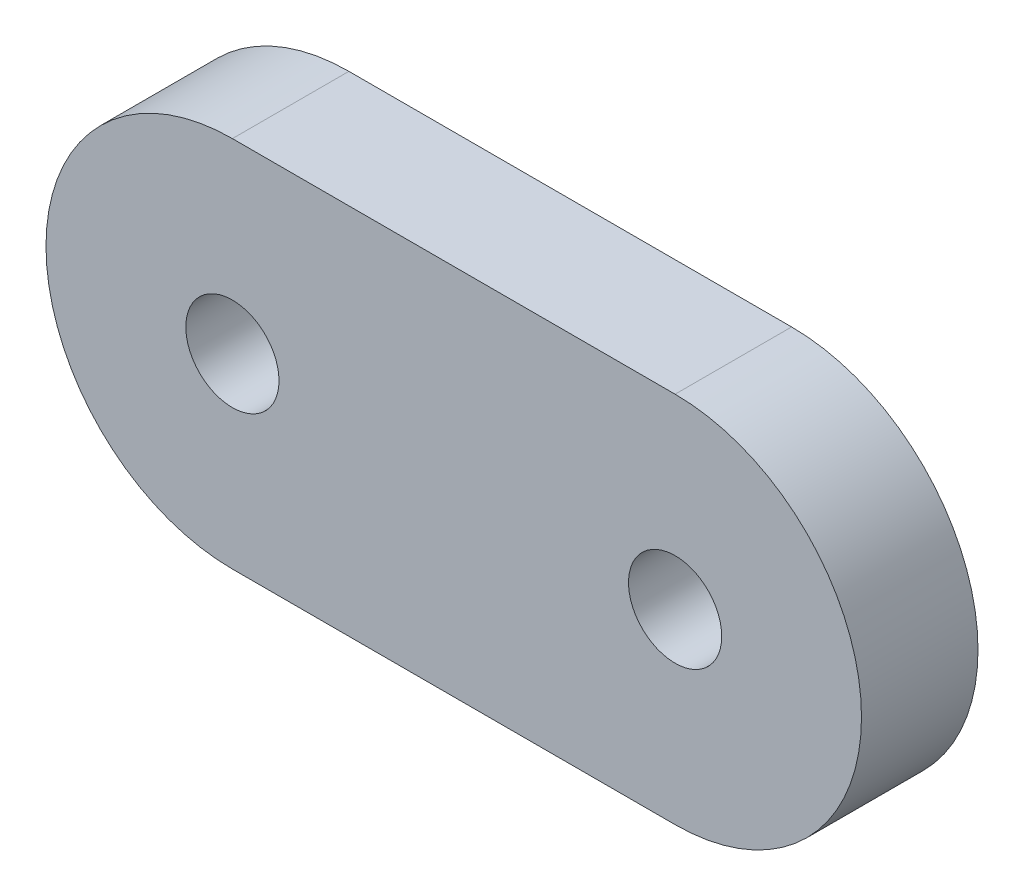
ISO-10303-21;
HEADER;
FILE_DESCRIPTION(('STEP AP214'),'2;1');
FILE_NAME('part.step','',(''),(''),'','','');
FILE_SCHEMA(('AUTOMOTIVE_DESIGN { 1 0 10303 214 1 1 1 1 }'));
ENDSEC;
DATA;
#1=APPLICATION_CONTEXT('core data for automotive mechanical design processes');
#2=APPLICATION_PROTOCOL_DEFINITION('international standard','automotive_design',2000,#1);
#3=PRODUCT_CONTEXT('',#1,'mechanical');
#4=PRODUCT('Part','Part','',(#3));
#5=PRODUCT_RELATED_PRODUCT_CATEGORY('part','',(#4));
#6=PRODUCT_DEFINITION_FORMATION('','',#4);
#7=PRODUCT_DEFINITION_CONTEXT('part definition',#1,'design');
#8=PRODUCT_DEFINITION('design','',#6,#7);
#9=PRODUCT_DEFINITION_SHAPE('','',#8);
#10=(LENGTH_UNIT() NAMED_UNIT(*) SI_UNIT(.MILLI.,.METRE.));
#11=(NAMED_UNIT(*) PLANE_ANGLE_UNIT() SI_UNIT($,.RADIAN.));
#12=(NAMED_UNIT(*) SI_UNIT($,.STERADIAN.) SOLID_ANGLE_UNIT());
#13=UNCERTAINTY_MEASURE_WITH_UNIT(LENGTH_MEASURE(1.E-05),#10,'distance_accuracy_value','');
#14=(GEOMETRIC_REPRESENTATION_CONTEXT(3) GLOBAL_UNCERTAINTY_ASSIGNED_CONTEXT((#13)) GLOBAL_UNIT_ASSIGNED_CONTEXT((#10,
#11,#12)) REPRESENTATION_CONTEXT('',''));
#15=CARTESIAN_POINT('',(0.,0.,0.));
#16=DIRECTION('',(0.,0.,1.));
#17=DIRECTION('',(1.,0.,0.));
#18=AXIS2_PLACEMENT_3D('',#15,#16,#17);
#19=CARTESIAN_POINT('',(0.,0.,6.35));
#20=DIRECTION('',(0.,0.,1.));
#21=DIRECTION('',(1.,0.,0.));
#22=AXIS2_PLACEMENT_3D('',#19,#20,#21);
#23=PLANE('',#22);
#24=CARTESIAN_POINT('',(0.,0.,6.35));
#25=DIRECTION('',(0.,0.,1.));
#26=DIRECTION('',(1.,0.,0.));
#27=AXIS2_PLACEMENT_3D('',#24,#25,#26);
#28=CIRCLE('',#27,2.54);
#29=CARTESIAN_POINT('',(2.54,0.,6.35));
#30=VERTEX_POINT('',#29);
#31=EDGE_CURVE('E102',#30,#30,#28,.T.);
#32=ORIENTED_EDGE('',*,*,#31,.F.);
#33=EDGE_LOOP('',(#32));
#34=FACE_BOUND('',#33,.T.);
#35=CARTESIAN_POINT('',(0.,0.,6.35));
#36=DIRECTION('',(0.,0.,1.));
#37=DIRECTION('',(1.,0.,0.));
#38=AXIS2_PLACEMENT_3D('',#35,#36,#37);
#39=CIRCLE('',#38,10.16);
#40=CARTESIAN_POINT('',(0.,10.16,6.35));
#41=VERTEX_POINT('',#40);
#42=CARTESIAN_POINT('',(0.,-10.16,6.35));
#43=VERTEX_POINT('',#42);
#44=EDGE_CURVE('E87',#41,#43,#39,.T.);
#45=ORIENTED_EDGE('',*,*,#44,.T.);
#46=DIRECTION('',(1.,0.,0.));
#47=VECTOR('',#46,1.);
#48=CARTESIAN_POINT('',(0.,-10.16,6.35));
#49=LINE('',#48,#47);
#50=CARTESIAN_POINT('',(24.13,-10.16,6.35));
#51=VERTEX_POINT('',#50);
#52=EDGE_CURVE('E82',#43,#51,#49,.T.);
#53=ORIENTED_EDGE('',*,*,#52,.T.);
#54=CARTESIAN_POINT('',(24.13,0.,6.35));
#55=DIRECTION('',(0.,0.,1.));
#56=DIRECTION('',(1.,0.,0.));
#57=AXIS2_PLACEMENT_3D('',#54,#55,#56);
#58=CIRCLE('',#57,10.16);
#59=CARTESIAN_POINT('',(24.13,10.16,6.35));
#60=VERTEX_POINT('',#59);
#61=EDGE_CURVE('E85',#51,#60,#58,.T.);
#62=ORIENTED_EDGE('',*,*,#61,.T.);
#63=DIRECTION('',(-1.,0.,0.));
#64=VECTOR('',#63,1.);
#65=CARTESIAN_POINT('',(0.,10.16,6.35));
#66=LINE('',#65,#64);
#67=EDGE_CURVE('E52',#60,#41,#66,.T.);
#68=ORIENTED_EDGE('',*,*,#67,.T.);
#69=EDGE_LOOP('',(#45,#53,#62,#68));
#70=FACE_BOUND('',#69,.T.);
#71=CARTESIAN_POINT('',(24.13,0.,6.35));
#72=DIRECTION('',(0.,0.,1.));
#73=DIRECTION('',(1.,0.,0.));
#74=AXIS2_PLACEMENT_3D('',#71,#72,#73);
#75=CIRCLE('',#74,2.54);
#76=CARTESIAN_POINT('',(26.67,0.,6.35));
#77=VERTEX_POINT('',#76);
#78=EDGE_CURVE('E117',#77,#77,#75,.T.);
#79=ORIENTED_EDGE('',*,*,#78,.F.);
#80=EDGE_LOOP('',(#79));
#81=FACE_BOUND('',#80,.T.);
#82=ADVANCED_FACE('F35',(#34,#70,#81),#23,.T.);
#83=CARTESIAN_POINT('',(0.,0.,0.));
#84=DIRECTION('',(0.,0.,1.));
#85=DIRECTION('',(1.,0.,0.));
#86=AXIS2_PLACEMENT_3D('',#83,#84,#85);
#87=PLANE('',#86);
#88=CARTESIAN_POINT('',(0.,0.,0.));
#89=DIRECTION('',(0.,0.,1.));
#90=DIRECTION('',(1.,0.,0.));
#91=AXIS2_PLACEMENT_3D('',#88,#89,#90);
#92=CIRCLE('',#91,10.16);
#93=CARTESIAN_POINT('',(0.,10.16,0.));
#94=VERTEX_POINT('',#93);
#95=CARTESIAN_POINT('',(0.,-10.16,0.));
#96=VERTEX_POINT('',#95);
#97=EDGE_CURVE('E99',#94,#96,#92,.T.);
#98=ORIENTED_EDGE('',*,*,#97,.F.);
#99=DIRECTION('',(-1.,0.,0.));
#100=VECTOR('',#99,1.);
#101=CARTESIAN_POINT('',(0.,10.16,0.));
#102=LINE('',#101,#100);
#103=CARTESIAN_POINT('',(24.13,10.16,0.));
#104=VERTEX_POINT('',#103);
#105=EDGE_CURVE('E75',#104,#94,#102,.T.);
#106=ORIENTED_EDGE('',*,*,#105,.F.);
#107=CARTESIAN_POINT('',(24.13,0.,0.));
#108=DIRECTION('',(0.,0.,1.));
#109=DIRECTION('',(1.,0.,0.));
#110=AXIS2_PLACEMENT_3D('',#107,#108,#109);
#111=CIRCLE('',#110,10.16);
#112=CARTESIAN_POINT('',(24.13,-10.16,0.));
#113=VERTEX_POINT('',#112);
#114=EDGE_CURVE('E69',#113,#104,#111,.T.);
#115=ORIENTED_EDGE('',*,*,#114,.F.);
#116=DIRECTION('',(1.,0.,0.));
#117=VECTOR('',#116,1.);
#118=CARTESIAN_POINT('',(0.,-10.16,0.));
#119=LINE('',#118,#117);
#120=EDGE_CURVE('E91',#96,#113,#119,.T.);
#121=ORIENTED_EDGE('',*,*,#120,.F.);
#122=EDGE_LOOP('',(#98,#106,#115,#121));
#123=FACE_BOUND('',#122,.T.);
#124=CARTESIAN_POINT('',(0.,0.,0.));
#125=DIRECTION('',(0.,0.,1.));
#126=DIRECTION('',(1.,0.,0.));
#127=AXIS2_PLACEMENT_3D('',#124,#125,#126);
#128=CIRCLE('',#127,2.54);
#129=CARTESIAN_POINT('',(2.54,0.,0.));
#130=VERTEX_POINT('',#129);
#131=EDGE_CURVE('E114',#130,#130,#128,.T.);
#132=ORIENTED_EDGE('',*,*,#131,.T.);
#133=EDGE_LOOP('',(#132));
#134=FACE_BOUND('',#133,.T.);
#135=CARTESIAN_POINT('',(24.13,0.,0.));
#136=DIRECTION('',(0.,0.,1.));
#137=DIRECTION('',(1.,0.,0.));
#138=AXIS2_PLACEMENT_3D('',#135,#136,#137);
#139=CIRCLE('',#138,2.54);
#140=CARTESIAN_POINT('',(26.67,0.,0.));
#141=VERTEX_POINT('',#140);
#142=EDGE_CURVE('E120',#141,#141,#139,.T.);
#143=ORIENTED_EDGE('',*,*,#142,.T.);
#144=EDGE_LOOP('',(#143));
#145=FACE_BOUND('',#144,.T.);
#146=ADVANCED_FACE('F110',(#123,#134,#145),#87,.F.);
#147=CARTESIAN_POINT('',(0.,0.,6.35));
#148=DIRECTION('',(0.,0.,-1.));
#149=DIRECTION('',(-1.,0.,0.));
#150=AXIS2_PLACEMENT_3D('',#147,#148,#149);
#151=CYLINDRICAL_SURFACE('',#150,10.16);
#152=ORIENTED_EDGE('',*,*,#97,.T.);
#153=DIRECTION('',(0.,0.,-1.));
#154=VECTOR('',#153,1.);
#155=CARTESIAN_POINT('',(0.,-10.16,6.35));
#156=LINE('',#155,#154);
#157=EDGE_CURVE('E11',#43,#96,#156,.T.);
#158=ORIENTED_EDGE('',*,*,#157,.F.);
#159=ORIENTED_EDGE('',*,*,#44,.F.);
#160=DIRECTION('',(0.,0.,-1.));
#161=VECTOR('',#160,1.);
#162=CARTESIAN_POINT('',(0.,10.16,6.35));
#163=LINE('',#162,#161);
#164=EDGE_CURVE('E95',#41,#94,#163,.T.);
#165=ORIENTED_EDGE('',*,*,#164,.T.);
#166=EDGE_LOOP('',(#152,#158,#159,#165));
#167=FACE_BOUND('',#166,.T.);
#168=ADVANCED_FACE('F37',(#167),#151,.T.);
#169=CARTESIAN_POINT('',(0.,-10.16,6.35));
#170=DIRECTION('',(0.,1.,0.));
#171=DIRECTION('',(-1.,0.,0.));
#172=AXIS2_PLACEMENT_3D('',#169,#170,#171);
#173=PLANE('',#172);
#174=ORIENTED_EDGE('',*,*,#120,.T.);
#175=DIRECTION('',(0.,0.,-1.));
#176=VECTOR('',#175,1.);
#177=CARTESIAN_POINT('',(24.13,-10.16,6.35));
#178=LINE('',#177,#176);
#179=EDGE_CURVE('E44',#51,#113,#178,.T.);
#180=ORIENTED_EDGE('',*,*,#179,.F.);
#181=ORIENTED_EDGE('',*,*,#52,.F.);
#182=ORIENTED_EDGE('',*,*,#157,.T.);
#183=EDGE_LOOP('',(#174,#180,#181,#182));
#184=FACE_BOUND('',#183,.T.);
#185=ADVANCED_FACE('F90',(#184),#173,.F.);
#186=CARTESIAN_POINT('',(24.13,0.,6.35));
#187=DIRECTION('',(0.,0.,-1.));
#188=DIRECTION('',(-1.,0.,0.));
#189=AXIS2_PLACEMENT_3D('',#186,#187,#188);
#190=CYLINDRICAL_SURFACE('',#189,10.16);
#191=ORIENTED_EDGE('',*,*,#114,.T.);
#192=DIRECTION('',(0.,0.,-1.));
#193=VECTOR('',#192,1.);
#194=CARTESIAN_POINT('',(24.13,10.16,6.35));
#195=LINE('',#194,#193);
#196=EDGE_CURVE('E92',#60,#104,#195,.T.);
#197=ORIENTED_EDGE('',*,*,#196,.F.);
#198=ORIENTED_EDGE('',*,*,#61,.F.);
#199=ORIENTED_EDGE('',*,*,#179,.T.);
#200=EDGE_LOOP('',(#191,#197,#198,#199));
#201=FACE_BOUND('',#200,.T.);
#202=ADVANCED_FACE('F93',(#201),#190,.T.);
#203=CARTESIAN_POINT('',(0.,10.16,6.35));
#204=DIRECTION('',(0.,-1.,0.));
#205=DIRECTION('',(1.,0.,0.));
#206=AXIS2_PLACEMENT_3D('',#203,#204,#205);
#207=PLANE('',#206);
#208=ORIENTED_EDGE('',*,*,#105,.T.);
#209=ORIENTED_EDGE('',*,*,#164,.F.);
#210=ORIENTED_EDGE('',*,*,#67,.F.);
#211=ORIENTED_EDGE('',*,*,#196,.T.);
#212=EDGE_LOOP('',(#208,#209,#210,#211));
#213=FACE_BOUND('',#212,.T.);
#214=ADVANCED_FACE('F107',(#213),#207,.F.);
#215=CARTESIAN_POINT('',(0.,0.,6.35));
#216=DIRECTION('',(0.,0.,-1.));
#217=DIRECTION('',(-1.,0.,0.));
#218=AXIS2_PLACEMENT_3D('',#215,#216,#217);
#219=CYLINDRICAL_SURFACE('',#218,2.54);
#220=ORIENTED_EDGE('',*,*,#31,.T.);
#221=EDGE_LOOP('',(#220));
#222=FACE_BOUND('',#221,.T.);
#223=ORIENTED_EDGE('',*,*,#131,.F.);
#224=EDGE_LOOP('',(#223));
#225=FACE_BOUND('',#224,.T.);
#226=ADVANCED_FACE('F137',(#222,#225),#219,.F.);
#227=CARTESIAN_POINT('',(24.13,0.,6.35));
#228=DIRECTION('',(0.,0.,-1.));
#229=DIRECTION('',(-1.,0.,0.));
#230=AXIS2_PLACEMENT_3D('',#227,#228,#229);
#231=CYLINDRICAL_SURFACE('',#230,2.54);
#232=ORIENTED_EDGE('',*,*,#78,.T.);
#233=EDGE_LOOP('',(#232));
#234=FACE_BOUND('',#233,.T.);
#235=ORIENTED_EDGE('',*,*,#142,.F.);
#236=EDGE_LOOP('',(#235));
#237=FACE_BOUND('',#236,.T.);
#238=ADVANCED_FACE('F126',(#234,#237),#231,.F.);
#239=CLOSED_SHELL('',(#82,#146,#168,#185,#202,#214,#226,#238));
#240=MANIFOLD_SOLID_BREP('B2',#239);
#241=ADVANCED_BREP_SHAPE_REPRESENTATION('',(#18,#240),#14);
#242=SHAPE_DEFINITION_REPRESENTATION(#9,#241);
ENDSEC;
END-ISO-10303-21;
